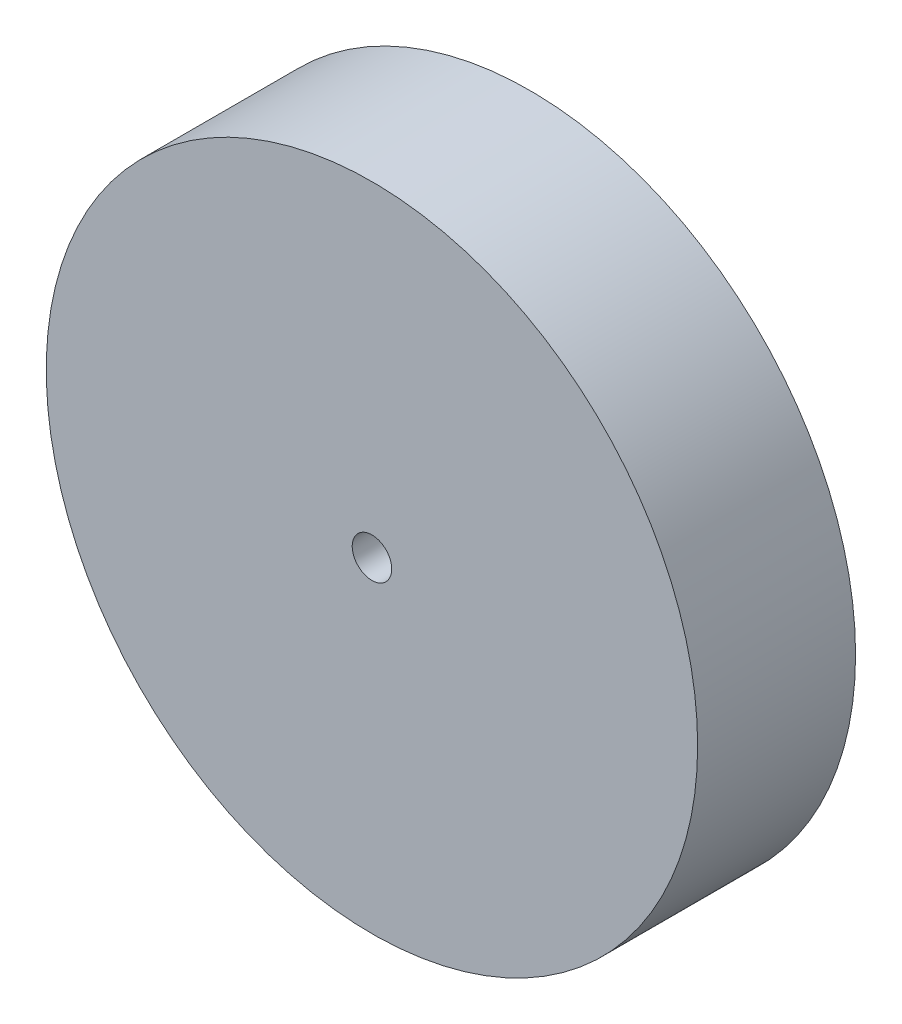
from build123d import *

# Parameters (mm, degrees)
ESQUISSE1_R        = 8.25
ESQUISSE1_R_2      = 0.5
BOSS_EXTRU_1_DEPTH = 4


with BuildPart() as part:
    # Esquisse1 → Boss.-Extru.1 (new body)
    with BuildSketch(Plane.XY):
        Circle(ESQUISSE1_R)
        Circle(ESQUISSE1_R_2, mode=Mode.SUBTRACT)
    extrude(amount=BOSS_EXTRU_1_DEPTH)


solid = part.part
